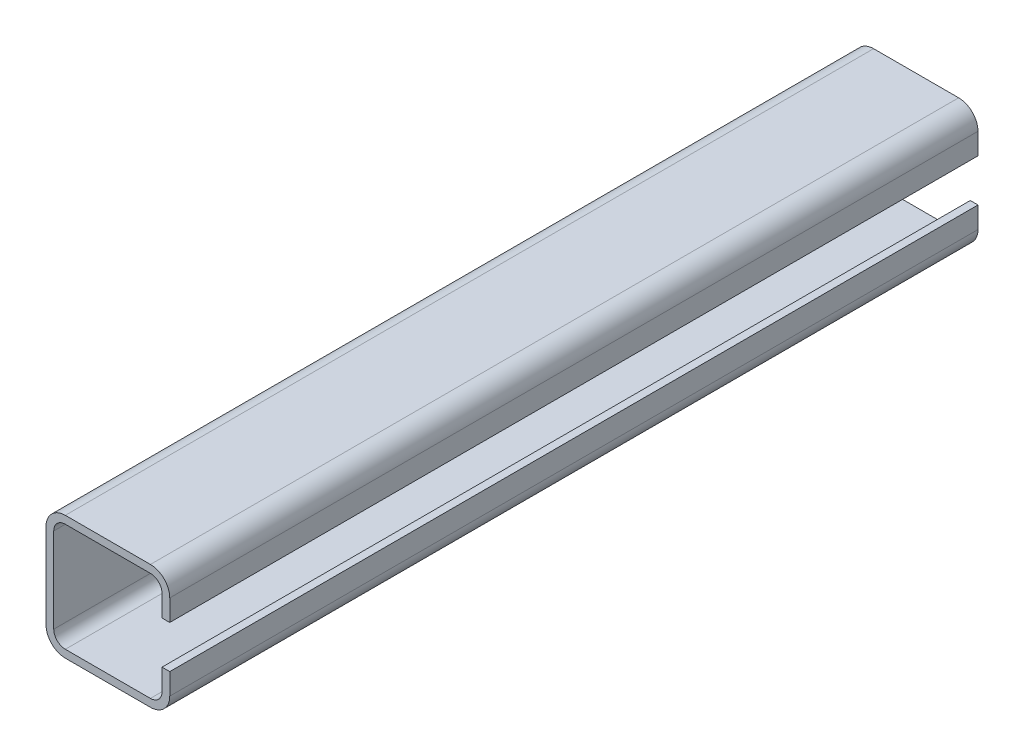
from build123d import *

# Parameters (mm, degrees)
BASE_EXTRUSION_DEPTH = 209


with BuildPart() as part:
    # Esquisse1 → Base-Extrusion (new body)
    with BuildSketch(Plane.XY):
        with BuildLine():
            Line((14, 5.5), (16, 5.5))
            Line((16, 5.5), (16, 11))
            ThreePointArc((16, 11), (14.535533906, 14.535533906), (11, 16))
            Line((11, 16), (-11, 16))
            ThreePointArc((-11, 16), (-14.535533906, 14.535533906), (-16, 11))
            Line((-16, 11), (-16, -11))
            ThreePointArc((-16, -11), (-14.535533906, -14.535533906), (-11, -16))
            Line((-11, -16), (11, -16))
            ThreePointArc((11, -16), (14.535533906, -14.535533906), (16, -11))
            Line((16, -11), (16, -5.5))
            Line((16, -5.5), (14, -5.5))
            Line((14, -5.5), (14, -11))
            ThreePointArc((14, -11), (13.121320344, -13.121320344), (11, -14))
            Line((11, -14), (-11, -14))
            ThreePointArc((-11, -14), (-13.121320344, -13.121320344), (-14, -11))
            Line((-14, -11), (-14, 11))
            ThreePointArc((-14, 11), (-13.121320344, 13.121320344), (-11, 14))
            Line((-11, 14), (11, 14))
            ThreePointArc((11, 14), (13.121320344, 13.121320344), (14, 11))
            Line((14, 11), (14, 5.5))
        make_face()
    extrude(amount=BASE_EXTRUSION_DEPTH)


solid = part.part
